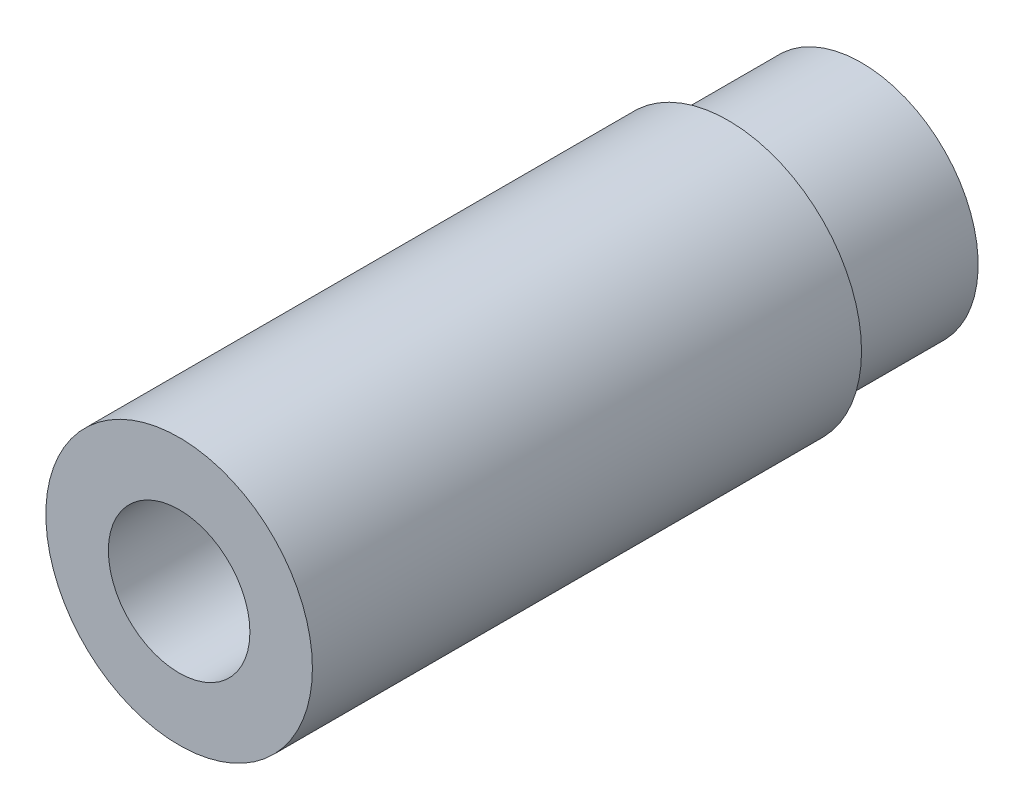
ISO-10303-21;
HEADER;
FILE_DESCRIPTION(('STEP AP214'),'2;1');
FILE_NAME('part.step','',(''),(''),'','','');
FILE_SCHEMA(('AUTOMOTIVE_DESIGN { 1 0 10303 214 1 1 1 1 }'));
ENDSEC;
DATA;
#1=APPLICATION_CONTEXT('core data for automotive mechanical design processes');
#2=APPLICATION_PROTOCOL_DEFINITION('international standard','automotive_design',2000,#1);
#3=PRODUCT_CONTEXT('',#1,'mechanical');
#4=PRODUCT('Part','Part','',(#3));
#5=PRODUCT_RELATED_PRODUCT_CATEGORY('part','',(#4));
#6=PRODUCT_DEFINITION_FORMATION('','',#4);
#7=PRODUCT_DEFINITION_CONTEXT('part definition',#1,'design');
#8=PRODUCT_DEFINITION('design','',#6,#7);
#9=PRODUCT_DEFINITION_SHAPE('','',#8);
#10=(LENGTH_UNIT() NAMED_UNIT(*) SI_UNIT(.MILLI.,.METRE.));
#11=(NAMED_UNIT(*) PLANE_ANGLE_UNIT() SI_UNIT($,.RADIAN.));
#12=(NAMED_UNIT(*) SI_UNIT($,.STERADIAN.) SOLID_ANGLE_UNIT());
#13=UNCERTAINTY_MEASURE_WITH_UNIT(LENGTH_MEASURE(1.E-05),#10,'distance_accuracy_value','');
#14=(GEOMETRIC_REPRESENTATION_CONTEXT(3) GLOBAL_UNCERTAINTY_ASSIGNED_CONTEXT((#13)) GLOBAL_UNIT_ASSIGNED_CONTEXT((#10,
#11,#12)) REPRESENTATION_CONTEXT('',''));
#15=CARTESIAN_POINT('',(0.,0.,0.));
#16=DIRECTION('',(0.,0.,1.));
#17=DIRECTION('',(1.,0.,0.));
#18=AXIS2_PLACEMENT_3D('',#15,#16,#17);
#19=CARTESIAN_POINT('',(0.,0.,52.324));
#20=DIRECTION('',(0.,0.,-1.));
#21=DIRECTION('',(-1.,0.,0.));
#22=AXIS2_PLACEMENT_3D('',#19,#20,#21);
#23=CYLINDRICAL_SURFACE('',#22,12.7);
#24=CARTESIAN_POINT('',(0.,0.,52.324));
#25=DIRECTION('',(0.,0.,1.));
#26=DIRECTION('',(1.,0.,0.));
#27=AXIS2_PLACEMENT_3D('',#24,#25,#26);
#28=CIRCLE('',#27,12.7);
#29=CARTESIAN_POINT('',(12.7,0.,52.324));
#30=VERTEX_POINT('',#29);
#31=EDGE_CURVE('E46',#30,#30,#28,.T.);
#32=ORIENTED_EDGE('',*,*,#31,.F.);
#33=EDGE_LOOP('',(#32));
#34=FACE_BOUND('',#33,.T.);
#35=CARTESIAN_POINT('',(0.,0.,0.));
#36=DIRECTION('',(0.,0.,1.));
#37=DIRECTION('',(1.,0.,0.));
#38=AXIS2_PLACEMENT_3D('',#35,#36,#37);
#39=CIRCLE('',#38,12.7);
#40=CARTESIAN_POINT('',(12.7,0.,0.));
#41=VERTEX_POINT('',#40);
#42=EDGE_CURVE('E42',#41,#41,#39,.T.);
#43=ORIENTED_EDGE('',*,*,#42,.T.);
#44=EDGE_LOOP('',(#43));
#45=FACE_BOUND('',#44,.T.);
#46=ADVANCED_FACE('F39',(#34,#45),#23,.T.);
#47=CARTESIAN_POINT('',(0.,0.,52.324));
#48=DIRECTION('',(0.,0.,1.));
#49=DIRECTION('',(1.,0.,0.));
#50=AXIS2_PLACEMENT_3D('',#47,#48,#49);
#51=PLANE('',#50);
#52=CARTESIAN_POINT('',(0.,0.,52.324));
#53=DIRECTION('',(0.,0.,1.));
#54=DIRECTION('',(1.,0.,0.));
#55=AXIS2_PLACEMENT_3D('',#52,#53,#54);
#56=CIRCLE('',#55,6.7437);
#57=CARTESIAN_POINT('',(6.7437,0.,52.324));
#58=VERTEX_POINT('',#57);
#59=EDGE_CURVE('E55',#58,#58,#56,.F.);
#60=ORIENTED_EDGE('',*,*,#59,.T.);
#61=EDGE_LOOP('',(#60));
#62=FACE_BOUND('',#61,.T.);
#63=ORIENTED_EDGE('',*,*,#31,.T.);
#64=EDGE_LOOP('',(#63));
#65=FACE_BOUND('',#64,.T.);
#66=ADVANCED_FACE('F83',(#62,#65),#51,.T.);
#67=CARTESIAN_POINT('',(0.,0.,0.));
#68=DIRECTION('',(0.,0.,1.));
#69=DIRECTION('',(1.,0.,0.));
#70=AXIS2_PLACEMENT_3D('',#67,#68,#69);
#71=PLANE('',#70);
#72=CARTESIAN_POINT('',(0.,0.,0.));
#73=DIRECTION('',(0.,0.,-1.));
#74=DIRECTION('',(-1.,0.,0.));
#75=AXIS2_PLACEMENT_3D('',#72,#73,#74);
#76=CIRCLE('',#75,11.1125);
#77=CARTESIAN_POINT('',(-11.1125,0.,0.));
#78=VERTEX_POINT('',#77);
#79=EDGE_CURVE('E11',#78,#78,#76,.T.);
#80=ORIENTED_EDGE('',*,*,#79,.F.);
#81=EDGE_LOOP('',(#80));
#82=FACE_BOUND('',#81,.T.);
#83=ORIENTED_EDGE('',*,*,#42,.F.);
#84=EDGE_LOOP('',(#83));
#85=FACE_BOUND('',#84,.T.);
#86=ADVANCED_FACE('F79',(#82,#85),#71,.F.);
#87=CARTESIAN_POINT('',(0.,0.,52.325));
#88=DIRECTION('',(0.,0.,-1.));
#89=DIRECTION('',(-1.,0.,0.));
#90=AXIS2_PLACEMENT_3D('',#87,#88,#89);
#91=CYLINDRICAL_SURFACE('',#90,6.7437);
#92=ORIENTED_EDGE('',*,*,#59,.F.);
#93=EDGE_LOOP('',(#92));
#94=FACE_BOUND('',#93,.T.);
#95=CARTESIAN_POINT('',(0.,0.,-12.7));
#96=DIRECTION('',(0.,0.,-1.));
#97=DIRECTION('',(-1.,0.,0.));
#98=AXIS2_PLACEMENT_3D('',#95,#96,#97);
#99=CIRCLE('',#98,6.7437);
#100=CARTESIAN_POINT('',(-6.7437,0.,-12.7));
#101=VERTEX_POINT('',#100);
#102=EDGE_CURVE('E61',#101,#101,#99,.T.);
#103=ORIENTED_EDGE('',*,*,#102,.T.);
#104=EDGE_LOOP('',(#103));
#105=FACE_BOUND('',#104,.T.);
#106=ADVANCED_FACE('F67',(#94,#105),#91,.F.);
#107=CARTESIAN_POINT('',(0.,0.,-12.7));
#108=DIRECTION('',(0.,0.,-1.));
#109=DIRECTION('',(-1.,0.,0.));
#110=AXIS2_PLACEMENT_3D('',#107,#108,#109);
#111=PLANE('',#110);
#112=CARTESIAN_POINT('',(0.,0.,-12.7));
#113=DIRECTION('',(0.,0.,-1.));
#114=DIRECTION('',(-1.,0.,0.));
#115=AXIS2_PLACEMENT_3D('',#112,#113,#114);
#116=CIRCLE('',#115,11.1125);
#117=CARTESIAN_POINT('',(-11.1125,0.,-12.7));
#118=VERTEX_POINT('',#117);
#119=EDGE_CURVE('E53',#118,#118,#116,.T.);
#120=ORIENTED_EDGE('',*,*,#119,.T.);
#121=EDGE_LOOP('',(#120));
#122=FACE_BOUND('',#121,.T.);
#123=ORIENTED_EDGE('',*,*,#102,.F.);
#124=EDGE_LOOP('',(#123));
#125=FACE_BOUND('',#124,.T.);
#126=ADVANCED_FACE('F69',(#122,#125),#111,.T.);
#127=CARTESIAN_POINT('',(0.,0.,-12.7));
#128=DIRECTION('',(0.,0.,1.));
#129=DIRECTION('',(1.,0.,0.));
#130=AXIS2_PLACEMENT_3D('',#127,#128,#129);
#131=CYLINDRICAL_SURFACE('',#130,11.1125);
#132=ORIENTED_EDGE('',*,*,#119,.F.);
#133=EDGE_LOOP('',(#132));
#134=FACE_BOUND('',#133,.T.);
#135=ORIENTED_EDGE('',*,*,#79,.T.);
#136=EDGE_LOOP('',(#135));
#137=FACE_BOUND('',#136,.T.);
#138=ADVANCED_FACE('F71',(#134,#137),#131,.T.);
#139=CLOSED_SHELL('',(#46,#66,#86,#106,#126,#138));
#140=MANIFOLD_SOLID_BREP('B2',#139);
#141=ADVANCED_BREP_SHAPE_REPRESENTATION('',(#18,#140),#14);
#142=SHAPE_DEFINITION_REPRESENTATION(#9,#141);
ENDSEC;
END-ISO-10303-21;
